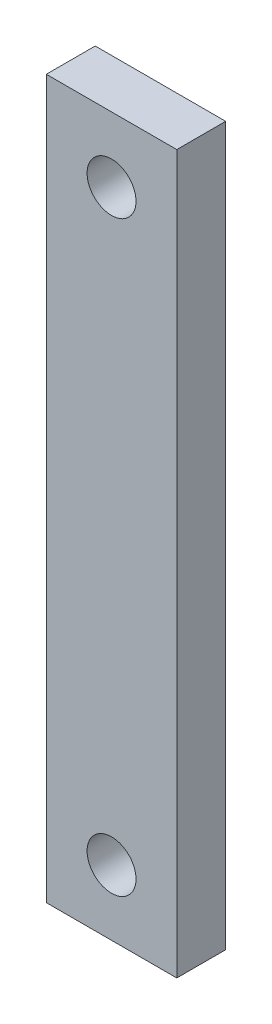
ISO-10303-21;
HEADER;
FILE_DESCRIPTION(('STEP AP214'),'2;1');
FILE_NAME('part.step','',(''),(''),'','','');
FILE_SCHEMA(('AUTOMOTIVE_DESIGN { 1 0 10303 214 1 1 1 1 }'));
ENDSEC;
DATA;
#1=APPLICATION_CONTEXT('core data for automotive mechanical design processes');
#2=APPLICATION_PROTOCOL_DEFINITION('international standard','automotive_design',2000,#1);
#3=PRODUCT_CONTEXT('',#1,'mechanical');
#4=PRODUCT('Part','Part','',(#3));
#5=PRODUCT_RELATED_PRODUCT_CATEGORY('part','',(#4));
#6=PRODUCT_DEFINITION_FORMATION('','',#4);
#7=PRODUCT_DEFINITION_CONTEXT('part definition',#1,'design');
#8=PRODUCT_DEFINITION('design','',#6,#7);
#9=PRODUCT_DEFINITION_SHAPE('','',#8);
#10=(LENGTH_UNIT() NAMED_UNIT(*) SI_UNIT(.MILLI.,.METRE.));
#11=(NAMED_UNIT(*) PLANE_ANGLE_UNIT() SI_UNIT($,.RADIAN.));
#12=(NAMED_UNIT(*) SI_UNIT($,.STERADIAN.) SOLID_ANGLE_UNIT());
#13=UNCERTAINTY_MEASURE_WITH_UNIT(LENGTH_MEASURE(1.E-05),#10,'distance_accuracy_value','');
#14=(GEOMETRIC_REPRESENTATION_CONTEXT(3) GLOBAL_UNCERTAINTY_ASSIGNED_CONTEXT((#13)) GLOBAL_UNIT_ASSIGNED_CONTEXT((#10,
#11,#12)) REPRESENTATION_CONTEXT('',''));
#15=CARTESIAN_POINT('',(0.,0.,0.));
#16=DIRECTION('',(0.,0.,1.));
#17=DIRECTION('',(1.,0.,0.));
#18=AXIS2_PLACEMENT_3D('',#15,#16,#17);
#19=CARTESIAN_POINT('',(-4.,-4.,3.));
#20=DIRECTION('',(0.,0.,1.));
#21=DIRECTION('',(1.,0.,0.));
#22=AXIS2_PLACEMENT_3D('',#19,#20,#21);
#23=PLANE('',#22);
#24=CARTESIAN_POINT('',(0.,36.,3.));
#25=DIRECTION('',(0.,0.,1.));
#26=DIRECTION('',(1.,0.,0.));
#27=AXIS2_PLACEMENT_3D('',#24,#25,#26);
#28=CIRCLE('',#27,1.5);
#29=CARTESIAN_POINT('',(1.5,36.,3.));
#30=VERTEX_POINT('',#29);
#31=EDGE_CURVE('E85',#30,#30,#28,.T.);
#32=ORIENTED_EDGE('',*,*,#31,.F.);
#33=EDGE_LOOP('',(#32));
#34=FACE_BOUND('',#33,.T.);
#35=DIRECTION('',(0.,-1.,0.));
#36=VECTOR('',#35,1.);
#37=CARTESIAN_POINT('',(-4.,40.,3.));
#38=LINE('',#37,#36);
#39=CARTESIAN_POINT('',(-4.,40.,3.));
#40=VERTEX_POINT('',#39);
#41=CARTESIAN_POINT('',(-4.,-4.,3.));
#42=VERTEX_POINT('',#41);
#43=EDGE_CURVE('E95',#40,#42,#38,.T.);
#44=ORIENTED_EDGE('',*,*,#43,.T.);
#45=DIRECTION('',(1.,0.,0.));
#46=VECTOR('',#45,1.);
#47=CARTESIAN_POINT('',(-4.,-4.,3.));
#48=LINE('',#47,#46);
#49=CARTESIAN_POINT('',(4.,-4.,3.));
#50=VERTEX_POINT('',#49);
#51=EDGE_CURVE('E80',#42,#50,#48,.T.);
#52=ORIENTED_EDGE('',*,*,#51,.T.);
#53=DIRECTION('',(0.,1.,0.));
#54=VECTOR('',#53,1.);
#55=CARTESIAN_POINT('',(4.,40.,3.));
#56=LINE('',#55,#54);
#57=CARTESIAN_POINT('',(4.,40.,3.));
#58=VERTEX_POINT('',#57);
#59=EDGE_CURVE('E46',#50,#58,#56,.T.);
#60=ORIENTED_EDGE('',*,*,#59,.T.);
#61=DIRECTION('',(-1.,0.,0.));
#62=VECTOR('',#61,1.);
#63=CARTESIAN_POINT('',(-4.,40.,3.));
#64=LINE('',#63,#62);
#65=EDGE_CURVE('E41',#58,#40,#64,.T.);
#66=ORIENTED_EDGE('',*,*,#65,.T.);
#67=EDGE_LOOP('',(#44,#52,#60,#66));
#68=FACE_BOUND('',#67,.T.);
#69=CARTESIAN_POINT('',(0.,0.,3.));
#70=DIRECTION('',(0.,0.,1.));
#71=DIRECTION('',(1.,0.,0.));
#72=AXIS2_PLACEMENT_3D('',#69,#70,#71);
#73=CIRCLE('',#72,1.5);
#74=CARTESIAN_POINT('',(1.5,0.,3.));
#75=VERTEX_POINT('',#74);
#76=EDGE_CURVE('E113',#75,#75,#73,.T.);
#77=ORIENTED_EDGE('',*,*,#76,.F.);
#78=EDGE_LOOP('',(#77));
#79=FACE_BOUND('',#78,.T.);
#80=ADVANCED_FACE('F26',(#34,#68,#79),#23,.T.);
#81=CARTESIAN_POINT('',(-4.,-4.,0.));
#82=DIRECTION('',(0.,0.,1.));
#83=DIRECTION('',(1.,0.,0.));
#84=AXIS2_PLACEMENT_3D('',#81,#82,#83);
#85=PLANE('',#84);
#86=CARTESIAN_POINT('',(0.,36.,0.));
#87=DIRECTION('',(0.,0.,1.));
#88=DIRECTION('',(1.,0.,0.));
#89=AXIS2_PLACEMENT_3D('',#86,#87,#88);
#90=CIRCLE('',#89,1.5);
#91=CARTESIAN_POINT('',(1.5,36.,0.));
#92=VERTEX_POINT('',#91);
#93=EDGE_CURVE('E88',#92,#92,#90,.T.);
#94=ORIENTED_EDGE('',*,*,#93,.T.);
#95=EDGE_LOOP('',(#94));
#96=FACE_BOUND('',#95,.T.);
#97=DIRECTION('',(0.,-1.,0.));
#98=VECTOR('',#97,1.);
#99=CARTESIAN_POINT('',(-4.,40.,0.));
#100=LINE('',#99,#98);
#101=CARTESIAN_POINT('',(-4.,40.,0.));
#102=VERTEX_POINT('',#101);
#103=CARTESIAN_POINT('',(-4.,-4.,0.));
#104=VERTEX_POINT('',#103);
#105=EDGE_CURVE('E72',#102,#104,#100,.T.);
#106=ORIENTED_EDGE('',*,*,#105,.F.);
#107=DIRECTION('',(-1.,0.,0.));
#108=VECTOR('',#107,1.);
#109=CARTESIAN_POINT('',(-4.,40.,0.));
#110=LINE('',#109,#108);
#111=CARTESIAN_POINT('',(4.,40.,0.));
#112=VERTEX_POINT('',#111);
#113=EDGE_CURVE('E93',#112,#102,#110,.T.);
#114=ORIENTED_EDGE('',*,*,#113,.F.);
#115=DIRECTION('',(0.,1.,0.));
#116=VECTOR('',#115,1.);
#117=CARTESIAN_POINT('',(4.,40.,0.));
#118=LINE('',#117,#116);
#119=CARTESIAN_POINT('',(4.,-4.,0.));
#120=VERTEX_POINT('',#119);
#121=EDGE_CURVE('E73',#120,#112,#118,.T.);
#122=ORIENTED_EDGE('',*,*,#121,.F.);
#123=DIRECTION('',(1.,0.,0.));
#124=VECTOR('',#123,1.);
#125=CARTESIAN_POINT('',(-4.,-4.,0.));
#126=LINE('',#125,#124);
#127=EDGE_CURVE('E67',#104,#120,#126,.T.);
#128=ORIENTED_EDGE('',*,*,#127,.F.);
#129=EDGE_LOOP('',(#106,#114,#122,#128));
#130=FACE_BOUND('',#129,.T.);
#131=CARTESIAN_POINT('',(0.,0.,0.));
#132=DIRECTION('',(0.,0.,1.));
#133=DIRECTION('',(1.,0.,0.));
#134=AXIS2_PLACEMENT_3D('',#131,#132,#133);
#135=CIRCLE('',#134,1.5);
#136=CARTESIAN_POINT('',(1.5,0.,0.));
#137=VERTEX_POINT('',#136);
#138=EDGE_CURVE('E115',#137,#137,#135,.T.);
#139=ORIENTED_EDGE('',*,*,#138,.T.);
#140=EDGE_LOOP('',(#139));
#141=FACE_BOUND('',#140,.T.);
#142=ADVANCED_FACE('F68',(#96,#130,#141),#85,.F.);
#143=CARTESIAN_POINT('',(-4.,40.,3.));
#144=DIRECTION('',(1.,0.,0.));
#145=DIRECTION('',(0.,0.,-1.));
#146=AXIS2_PLACEMENT_3D('',#143,#144,#145);
#147=PLANE('',#146);
#148=ORIENTED_EDGE('',*,*,#105,.T.);
#149=DIRECTION('',(0.,0.,-1.));
#150=VECTOR('',#149,1.);
#151=CARTESIAN_POINT('',(-4.,-4.,3.));
#152=LINE('',#151,#150);
#153=EDGE_CURVE('E11',#42,#104,#152,.T.);
#154=ORIENTED_EDGE('',*,*,#153,.F.);
#155=ORIENTED_EDGE('',*,*,#43,.F.);
#156=DIRECTION('',(0.,0.,-1.));
#157=VECTOR('',#156,1.);
#158=CARTESIAN_POINT('',(-4.,40.,3.));
#159=LINE('',#158,#157);
#160=EDGE_CURVE('E84',#40,#102,#159,.T.);
#161=ORIENTED_EDGE('',*,*,#160,.T.);
#162=EDGE_LOOP('',(#148,#154,#155,#161));
#163=FACE_BOUND('',#162,.T.);
#164=ADVANCED_FACE('F28',(#163),#147,.F.);
#165=CARTESIAN_POINT('',(-4.,-4.,3.));
#166=DIRECTION('',(0.,1.,0.));
#167=DIRECTION('',(0.,0.,1.));
#168=AXIS2_PLACEMENT_3D('',#165,#166,#167);
#169=PLANE('',#168);
#170=ORIENTED_EDGE('',*,*,#127,.T.);
#171=DIRECTION('',(0.,0.,-1.));
#172=VECTOR('',#171,1.);
#173=CARTESIAN_POINT('',(4.,-4.,3.));
#174=LINE('',#173,#172);
#175=EDGE_CURVE('E34',#50,#120,#174,.T.);
#176=ORIENTED_EDGE('',*,*,#175,.F.);
#177=ORIENTED_EDGE('',*,*,#51,.F.);
#178=ORIENTED_EDGE('',*,*,#153,.T.);
#179=EDGE_LOOP('',(#170,#176,#177,#178));
#180=FACE_BOUND('',#179,.T.);
#181=ADVANCED_FACE('F79',(#180),#169,.F.);
#182=CARTESIAN_POINT('',(4.,40.,3.));
#183=DIRECTION('',(-1.,0.,0.));
#184=DIRECTION('',(0.,0.,1.));
#185=AXIS2_PLACEMENT_3D('',#182,#183,#184);
#186=PLANE('',#185);
#187=ORIENTED_EDGE('',*,*,#121,.T.);
#188=DIRECTION('',(0.,0.,-1.));
#189=VECTOR('',#188,1.);
#190=CARTESIAN_POINT('',(4.,40.,3.));
#191=LINE('',#190,#189);
#192=EDGE_CURVE('E101',#58,#112,#191,.T.);
#193=ORIENTED_EDGE('',*,*,#192,.F.);
#194=ORIENTED_EDGE('',*,*,#59,.F.);
#195=ORIENTED_EDGE('',*,*,#175,.T.);
#196=EDGE_LOOP('',(#187,#193,#194,#195));
#197=FACE_BOUND('',#196,.T.);
#198=ADVANCED_FACE('F104',(#197),#186,.F.);
#199=CARTESIAN_POINT('',(-4.,40.,3.));
#200=DIRECTION('',(0.,-1.,0.));
#201=DIRECTION('',(0.,0.,-1.));
#202=AXIS2_PLACEMENT_3D('',#199,#200,#201);
#203=PLANE('',#202);
#204=ORIENTED_EDGE('',*,*,#113,.T.);
#205=ORIENTED_EDGE('',*,*,#160,.F.);
#206=ORIENTED_EDGE('',*,*,#65,.F.);
#207=ORIENTED_EDGE('',*,*,#192,.T.);
#208=EDGE_LOOP('',(#204,#205,#206,#207));
#209=FACE_BOUND('',#208,.T.);
#210=ADVANCED_FACE('F106',(#209),#203,.F.);
#211=CARTESIAN_POINT('',(0.,36.,3.));
#212=DIRECTION('',(0.,0.,-1.));
#213=DIRECTION('',(-1.,0.,0.));
#214=AXIS2_PLACEMENT_3D('',#211,#212,#213);
#215=CYLINDRICAL_SURFACE('',#214,1.5);
#216=ORIENTED_EDGE('',*,*,#31,.T.);
#217=EDGE_LOOP('',(#216));
#218=FACE_BOUND('',#217,.T.);
#219=ORIENTED_EDGE('',*,*,#93,.F.);
#220=EDGE_LOOP('',(#219));
#221=FACE_BOUND('',#220,.T.);
#222=ADVANCED_FACE('F124',(#218,#221),#215,.F.);
#223=CARTESIAN_POINT('',(0.,0.,3.));
#224=DIRECTION('',(0.,0.,-1.));
#225=DIRECTION('',(-1.,0.,0.));
#226=AXIS2_PLACEMENT_3D('',#223,#224,#225);
#227=CYLINDRICAL_SURFACE('',#226,1.5);
#228=ORIENTED_EDGE('',*,*,#76,.T.);
#229=EDGE_LOOP('',(#228));
#230=FACE_BOUND('',#229,.T.);
#231=ORIENTED_EDGE('',*,*,#138,.F.);
#232=EDGE_LOOP('',(#231));
#233=FACE_BOUND('',#232,.T.);
#234=ADVANCED_FACE('F122',(#230,#233),#227,.F.);
#235=CLOSED_SHELL('',(#80,#142,#164,#181,#198,#210,#222,#234));
#236=MANIFOLD_SOLID_BREP('B2',#235);
#237=ADVANCED_BREP_SHAPE_REPRESENTATION('',(#18,#236),#14);
#238=SHAPE_DEFINITION_REPRESENTATION(#9,#237);
ENDSEC;
END-ISO-10303-21;
